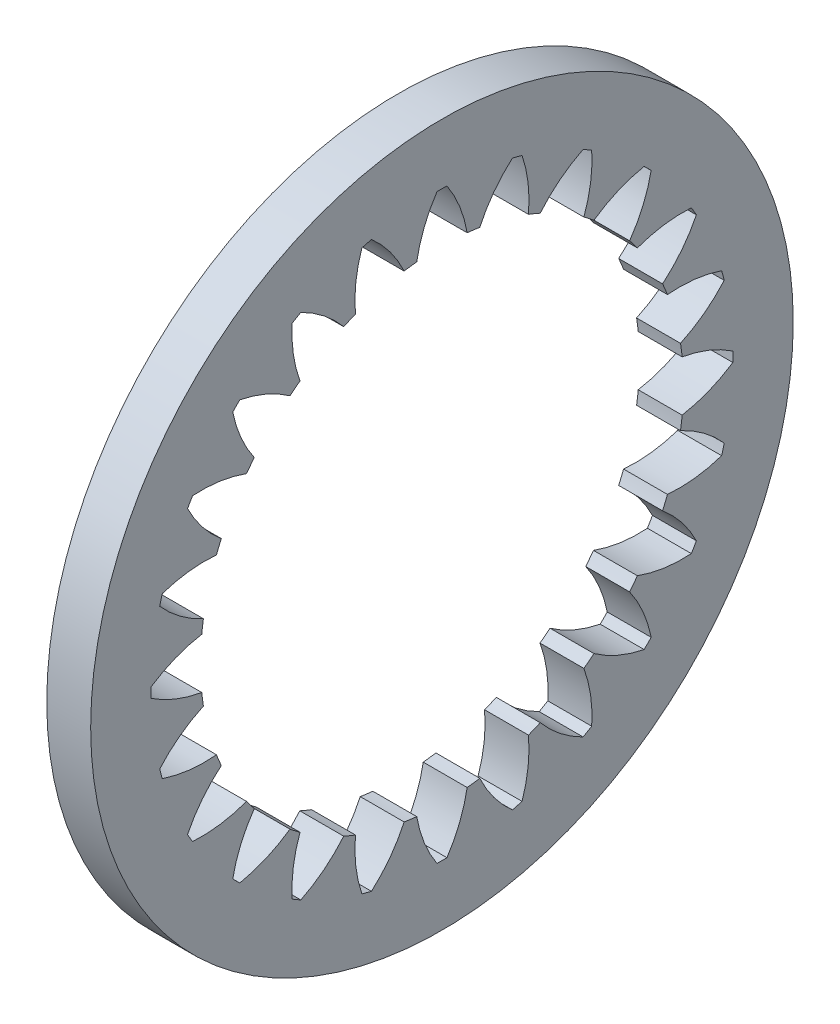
from build123d import *

# Parameters (mm, degrees)
BASPROSKE_W     = 12.7
BASPROSKE_H     = 31.75
TOOTHCUT_DEPTH  = 145.244271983
TEETHCUTS_COUNT = 24
TEETHCUTS_ANGLE = 345


with BuildPart() as part:
    # BasProSke → Base-Revolve (revolve)
    with BuildSketch(Plane(origin=(0, 0, 0), x_dir=(1, 0, 0), z_dir=(0, 1, 0)), mode=Mode.PRIVATE) as base_revolve_sk:
        with Locations((6.35, 85.725)):
            Rectangle(BASPROSKE_W, BASPROSKE_H)
    revolve(base_revolve_sk.sketch.rotate(Axis((-10, 0, 0), (1, 0, 0)), 180), axis=Axis((-10, 0, 0), (1, 0, 0)))

    # TooCutSke → ToothCut (cut, through all)
    with BuildSketch(Plane(origin=(0, 0, 0), x_dir=(0, 0, -1), z_dir=(1, 0, 0))):
        with BuildLine():
            ThreePointArc((7.294804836, 69.442498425), (5.138539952, 77.091294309), (1.442489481, 84.126403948))
            ThreePointArc((1.442489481, 84.126403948), (0, 84.13877), (-1.442489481, 84.126403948))
            ThreePointArc((-1.442489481, 84.126403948), (-5.138539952, 77.091294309), (-7.294804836, 69.442498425))
            ThreePointArc((-7.294804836, 69.442498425), (0, 69.8246), (7.294804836, 69.442498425))
        make_face()
    toothcut = extrude(amount=TOOTHCUT_DEPTH, mode=Mode.SUBTRACT)

    # TeethCuts: ToothCut ×24 about axis
    teethcuts_axis = Axis((-10, 0, 0), (1, 0, 0))
    for i in range(1, TEETHCUTS_COUNT):
        add(toothcut.rotate(teethcuts_axis, i * TEETHCUTS_ANGLE / (TEETHCUTS_COUNT - 1)), mode=Mode.SUBTRACT)


solid = part.part
